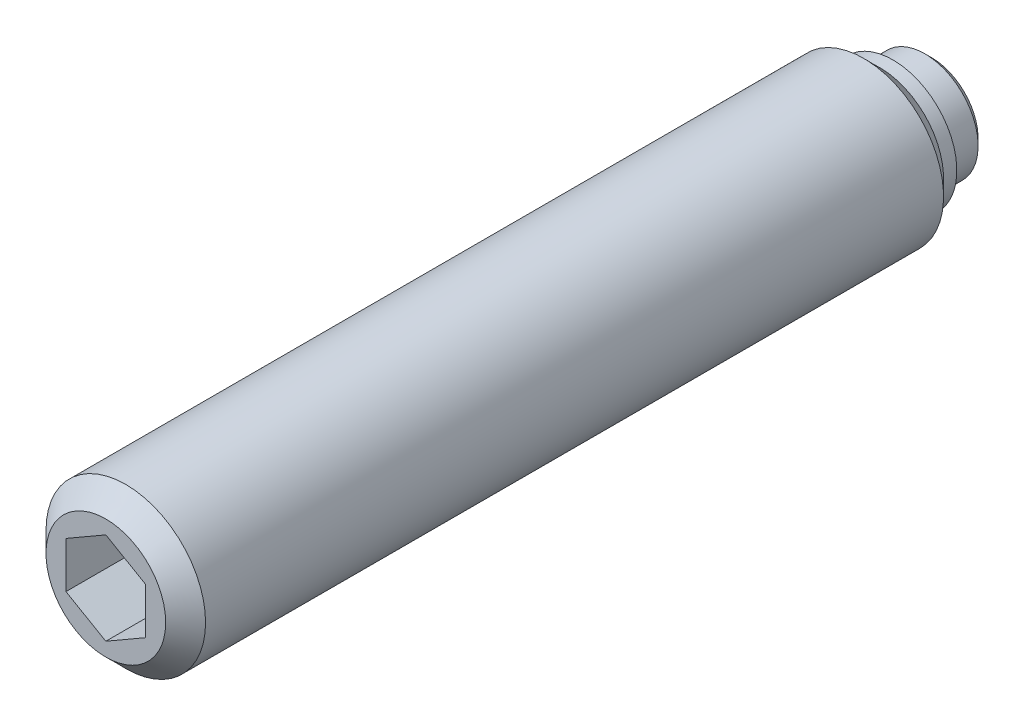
ISO-10303-21;
HEADER;
FILE_DESCRIPTION(('STEP AP214'),'2;1');
FILE_NAME('part.step','',(''),(''),'','','');
FILE_SCHEMA(('AUTOMOTIVE_DESIGN { 1 0 10303 214 1 1 1 1 }'));
ENDSEC;
DATA;
#1=APPLICATION_CONTEXT('core data for automotive mechanical design processes');
#2=APPLICATION_PROTOCOL_DEFINITION('international standard','automotive_design',2000,#1);
#3=PRODUCT_CONTEXT('',#1,'mechanical');
#4=PRODUCT('Part','Part','',(#3));
#5=PRODUCT_RELATED_PRODUCT_CATEGORY('part','',(#4));
#6=PRODUCT_DEFINITION_FORMATION('','',#4);
#7=PRODUCT_DEFINITION_CONTEXT('part definition',#1,'design');
#8=PRODUCT_DEFINITION('design','',#6,#7);
#9=PRODUCT_DEFINITION_SHAPE('','',#8);
#10=(LENGTH_UNIT() NAMED_UNIT(*) SI_UNIT(.MILLI.,.METRE.));
#11=(NAMED_UNIT(*) PLANE_ANGLE_UNIT() SI_UNIT($,.RADIAN.));
#12=(NAMED_UNIT(*) SI_UNIT($,.STERADIAN.) SOLID_ANGLE_UNIT());
#13=UNCERTAINTY_MEASURE_WITH_UNIT(LENGTH_MEASURE(1.E-05),#10,'distance_accuracy_value','');
#14=(GEOMETRIC_REPRESENTATION_CONTEXT(3) GLOBAL_UNCERTAINTY_ASSIGNED_CONTEXT((#13)) GLOBAL_UNIT_ASSIGNED_CONTEXT((#10,
#11,#12)) REPRESENTATION_CONTEXT('',''));
#15=CARTESIAN_POINT('',(0.,0.,0.));
#16=DIRECTION('',(0.,0.,1.));
#17=DIRECTION('',(1.,0.,0.));
#18=AXIS2_PLACEMENT_3D('',#15,#16,#17);
#19=CARTESIAN_POINT('',(0.,0.,0.));
#20=DIRECTION('',(0.,0.,-1.));
#21=DIRECTION('',(-1.,0.,0.));
#22=AXIS2_PLACEMENT_3D('',#19,#20,#21);
#23=CYLINDRICAL_SURFACE('',#22,4.);
#24=CARTESIAN_POINT('',(0.,0.,0.5));
#25=DIRECTION('',(0.,0.,-1.));
#26=DIRECTION('',(-1.,0.,0.));
#27=AXIS2_PLACEMENT_3D('',#24,#25,#26);
#28=CIRCLE('',#27,4.);
#29=CARTESIAN_POINT('',(-4.,0.,0.5));
#30=VERTEX_POINT('',#29);
#31=EDGE_CURVE('E133',#30,#30,#28,.T.);
#32=ORIENTED_EDGE('',*,*,#31,.F.);
#33=EDGE_LOOP('',(#32));
#34=FACE_BOUND('',#33,.T.);
#35=CARTESIAN_POINT('',(0.,0.,2.9));
#36=DIRECTION('',(0.,0.,-1.));
#37=DIRECTION('',(-1.,0.,0.));
#38=AXIS2_PLACEMENT_3D('',#35,#36,#37);
#39=CIRCLE('',#38,4.);
#40=CARTESIAN_POINT('',(-4.,0.,2.9));
#41=VERTEX_POINT('',#40);
#42=EDGE_CURVE('E127',#41,#41,#39,.T.);
#43=ORIENTED_EDGE('',*,*,#42,.T.);
#44=EDGE_LOOP('',(#43));
#45=FACE_BOUND('',#44,.T.);
#46=ADVANCED_FACE('F14',(#34,#45),#23,.T.);
#47=CARTESIAN_POINT('',(0.,0.,0.5));
#48=DIRECTION('',(0.,0.,1.));
#49=DIRECTION('',(1.,0.,0.));
#50=AXIS2_PLACEMENT_3D('',#47,#48,#49);
#51=CONICAL_SURFACE('',#50,4.,0.785398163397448);
#52=CARTESIAN_POINT('',(0.,0.,0.));
#53=DIRECTION('',(0.,0.,-1.));
#54=DIRECTION('',(-1.,0.,0.));
#55=AXIS2_PLACEMENT_3D('',#52,#53,#54);
#56=CIRCLE('',#55,3.5);
#57=CARTESIAN_POINT('',(-3.5,0.,0.));
#58=VERTEX_POINT('',#57);
#59=EDGE_CURVE('E130',#58,#58,#56,.T.);
#60=ORIENTED_EDGE('',*,*,#59,.F.);
#61=EDGE_LOOP('',(#60));
#62=FACE_BOUND('',#61,.T.);
#63=ORIENTED_EDGE('',*,*,#31,.T.);
#64=EDGE_LOOP('',(#63));
#65=FACE_BOUND('',#64,.T.);
#66=ADVANCED_FACE('F159',(#62,#65),#51,.T.);
#67=CARTESIAN_POINT('',(0.,3.5,0.));
#68=DIRECTION('',(0.,0.,1.));
#69=DIRECTION('',(1.,0.,0.));
#70=AXIS2_PLACEMENT_3D('',#67,#68,#69);
#71=PLANE('',#70);
#72=ORIENTED_EDGE('',*,*,#59,.T.);
#73=EDGE_LOOP('',(#72));
#74=FACE_BOUND('',#73,.T.);
#75=ADVANCED_FACE('F165',(#74),#71,.F.);
#76=CARTESIAN_POINT('',(0.,0.,2.9));
#77=DIRECTION('',(0.,0.,-1.));
#78=DIRECTION('',(-1.,0.,0.));
#79=AXIS2_PLACEMENT_3D('',#76,#77,#78);
#80=CYLINDRICAL_SURFACE('',#79,6.);
#81=CARTESIAN_POINT('',(0.,0.,5.1));
#82=DIRECTION('',(0.,0.,-1.));
#83=DIRECTION('',(-1.,0.,0.));
#84=AXIS2_PLACEMENT_3D('',#81,#82,#83);
#85=CIRCLE('',#84,6.);
#86=CARTESIAN_POINT('',(-6.,0.,5.1));
#87=VERTEX_POINT('',#86);
#88=EDGE_CURVE('E9',#87,#87,#85,.T.);
#89=ORIENTED_EDGE('',*,*,#88,.F.);
#90=EDGE_LOOP('',(#89));
#91=FACE_BOUND('',#90,.T.);
#92=CARTESIAN_POINT('',(0.,0.,60.6));
#93=DIRECTION('',(0.,0.,1.));
#94=DIRECTION('',(1.,0.,0.));
#95=AXIS2_PLACEMENT_3D('',#92,#93,#94);
#96=CIRCLE('',#95,6.);
#97=CARTESIAN_POINT('',(6.,0.,60.6));
#98=VERTEX_POINT('',#97);
#99=EDGE_CURVE('E124',#98,#98,#96,.T.);
#100=ORIENTED_EDGE('',*,*,#99,.F.);
#101=EDGE_LOOP('',(#100));
#102=FACE_BOUND('',#101,.T.);
#103=ADVANCED_FACE('F16',(#91,#102),#80,.T.);
#104=CARTESIAN_POINT('',(0.,4.8,2.9));
#105=DIRECTION('',(0.,0.,1.));
#106=DIRECTION('',(1.,0.,0.));
#107=AXIS2_PLACEMENT_3D('',#104,#105,#106);
#108=PLANE('',#107);
#109=CARTESIAN_POINT('',(0.,0.,2.9));
#110=DIRECTION('',(0.,0.,-1.));
#111=DIRECTION('',(-1.,0.,0.));
#112=AXIS2_PLACEMENT_3D('',#109,#110,#111);
#113=CIRCLE('',#112,4.8);
#114=CARTESIAN_POINT('',(-4.8,0.,2.9));
#115=VERTEX_POINT('',#114);
#116=EDGE_CURVE('E136',#115,#115,#113,.T.);
#117=ORIENTED_EDGE('',*,*,#116,.T.);
#118=EDGE_LOOP('',(#117));
#119=FACE_BOUND('',#118,.T.);
#120=ORIENTED_EDGE('',*,*,#42,.F.);
#121=EDGE_LOOP('',(#120));
#122=FACE_BOUND('',#121,.T.);
#123=ADVANCED_FACE('F156',(#119,#122),#108,.F.);
#124=CARTESIAN_POINT('',(0.,0.,2.9));
#125=DIRECTION('',(0.,0.,-1.));
#126=DIRECTION('',(-1.,0.,0.));
#127=AXIS2_PLACEMENT_3D('',#124,#125,#126);
#128=CYLINDRICAL_SURFACE('',#127,4.8);
#129=CARTESIAN_POINT('',(0.,0.,3.9));
#130=DIRECTION('',(0.,0.,-1.));
#131=DIRECTION('',(-1.,0.,0.));
#132=AXIS2_PLACEMENT_3D('',#129,#130,#131);
#133=CIRCLE('',#132,4.8);
#134=CARTESIAN_POINT('',(-4.8,0.,3.9));
#135=VERTEX_POINT('',#134);
#136=EDGE_CURVE('E22',#135,#135,#133,.T.);
#137=ORIENTED_EDGE('',*,*,#136,.T.);
#138=EDGE_LOOP('',(#137));
#139=FACE_BOUND('',#138,.T.);
#140=ORIENTED_EDGE('',*,*,#116,.F.);
#141=EDGE_LOOP('',(#140));
#142=FACE_BOUND('',#141,.T.);
#143=ADVANCED_FACE('F141',(#139,#142),#128,.T.);
#144=CARTESIAN_POINT('',(0.,0.,5.1));
#145=DIRECTION('',(0.,0.,1.));
#146=DIRECTION('',(1.,0.,0.));
#147=AXIS2_PLACEMENT_3D('',#144,#145,#146);
#148=CONICAL_SURFACE('',#147,6.,0.785398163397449);
#149=ORIENTED_EDGE('',*,*,#88,.T.);
#150=EDGE_LOOP('',(#149));
#151=FACE_BOUND('',#150,.T.);
#152=ORIENTED_EDGE('',*,*,#136,.F.);
#153=EDGE_LOOP('',(#152));
#154=FACE_BOUND('',#153,.T.);
#155=ADVANCED_FACE('F144',(#151,#154),#148,.T.);
#156=CARTESIAN_POINT('',(0.,-4.5,62.1));
#157=DIRECTION('',(0.,0.,1.));
#158=DIRECTION('',(1.,0.,0.));
#159=AXIS2_PLACEMENT_3D('',#156,#157,#158);
#160=PLANE('',#159);
#161=DIRECTION('',(0.866025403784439,-0.5,0.));
#162=VECTOR('',#161,1.);
#163=CARTESIAN_POINT('',(-3.,-1.73205080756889,62.1));
#164=LINE('',#163,#162);
#165=CARTESIAN_POINT('',(-3.,-1.73205080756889,62.1));
#166=VERTEX_POINT('',#165);
#167=CARTESIAN_POINT('',(0.,-3.46410161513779,62.1));
#168=VERTEX_POINT('',#167);
#169=EDGE_CURVE('E29',#166,#168,#164,.T.);
#170=ORIENTED_EDGE('',*,*,#169,.F.);
#171=DIRECTION('',(0.,-1.,0.));
#172=VECTOR('',#171,1.);
#173=CARTESIAN_POINT('',(-3.,1.73205080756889,62.1));
#174=LINE('',#173,#172);
#175=CARTESIAN_POINT('',(-3.,1.73205080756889,62.1));
#176=VERTEX_POINT('',#175);
#177=EDGE_CURVE('E112',#176,#166,#174,.T.);
#178=ORIENTED_EDGE('',*,*,#177,.F.);
#179=DIRECTION('',(-0.866025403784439,-0.5,0.));
#180=VECTOR('',#179,1.);
#181=CARTESIAN_POINT('',(0.,3.46410161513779,62.1));
#182=LINE('',#181,#180);
#183=CARTESIAN_POINT('',(0.,3.46410161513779,62.1));
#184=VERTEX_POINT('',#183);
#185=EDGE_CURVE('E110',#184,#176,#182,.T.);
#186=ORIENTED_EDGE('',*,*,#185,.F.);
#187=DIRECTION('',(-0.866025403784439,0.5,0.));
#188=VECTOR('',#187,1.);
#189=CARTESIAN_POINT('',(3.,1.73205080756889,62.1));
#190=LINE('',#189,#188);
#191=CARTESIAN_POINT('',(3.,1.73205080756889,62.1));
#192=VERTEX_POINT('',#191);
#193=EDGE_CURVE('E77',#192,#184,#190,.T.);
#194=ORIENTED_EDGE('',*,*,#193,.F.);
#195=DIRECTION('',(0.,1.,0.));
#196=VECTOR('',#195,1.);
#197=CARTESIAN_POINT('',(3.,-1.73205080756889,62.1));
#198=LINE('',#197,#196);
#199=CARTESIAN_POINT('',(3.,-1.73205080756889,62.1));
#200=VERTEX_POINT('',#199);
#201=EDGE_CURVE('E106',#200,#192,#198,.T.);
#202=ORIENTED_EDGE('',*,*,#201,.F.);
#203=DIRECTION('',(0.866025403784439,0.5,0.));
#204=VECTOR('',#203,1.);
#205=CARTESIAN_POINT('',(0.,-3.46410161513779,62.1));
#206=LINE('',#205,#204);
#207=EDGE_CURVE('E103',#168,#200,#206,.T.);
#208=ORIENTED_EDGE('',*,*,#207,.F.);
#209=EDGE_LOOP('',(#170,#178,#186,#194,#202,#208));
#210=FACE_BOUND('',#209,.T.);
#211=CARTESIAN_POINT('',(0.,0.,62.1));
#212=DIRECTION('',(0.,0.,1.));
#213=DIRECTION('',(1.,0.,0.));
#214=AXIS2_PLACEMENT_3D('',#211,#212,#213);
#215=CIRCLE('',#214,4.5);
#216=CARTESIAN_POINT('',(4.5,0.,62.1));
#217=VERTEX_POINT('',#216);
#218=EDGE_CURVE('E116',#217,#217,#215,.T.);
#219=ORIENTED_EDGE('',*,*,#218,.T.);
#220=EDGE_LOOP('',(#219));
#221=FACE_BOUND('',#220,.T.);
#222=ADVANCED_FACE('F146',(#210,#221),#160,.T.);
#223=CARTESIAN_POINT('',(0.,0.,62.1));
#224=DIRECTION('',(0.,0.,-1.));
#225=DIRECTION('',(-1.,0.,0.));
#226=AXIS2_PLACEMENT_3D('',#223,#224,#225);
#227=CONICAL_SURFACE('',#226,4.5,0.785398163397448);
#228=ORIENTED_EDGE('',*,*,#99,.T.);
#229=EDGE_LOOP('',(#228));
#230=FACE_BOUND('',#229,.T.);
#231=ORIENTED_EDGE('',*,*,#218,.F.);
#232=EDGE_LOOP('',(#231));
#233=FACE_BOUND('',#232,.T.);
#234=ADVANCED_FACE('F153',(#230,#233),#227,.T.);
#235=CARTESIAN_POINT('',(-3.,-1.73205080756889,54.1));
#236=DIRECTION('',(-0.5,-0.866025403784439,0.));
#237=DIRECTION('',(0.866025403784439,-0.5,0.));
#238=AXIS2_PLACEMENT_3D('',#235,#236,#237);
#239=PLANE('',#238);
#240=ORIENTED_EDGE('',*,*,#169,.T.);
#241=DIRECTION('',(0.,0.,1.));
#242=VECTOR('',#241,1.);
#243=CARTESIAN_POINT('',(0.,-3.46410161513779,54.1));
#244=LINE('',#243,#242);
#245=CARTESIAN_POINT('',(0.,-3.46410161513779,54.1));
#246=VERTEX_POINT('',#245);
#247=EDGE_CURVE('E59',#246,#168,#244,.T.);
#248=ORIENTED_EDGE('',*,*,#247,.F.);
#249=DIRECTION('',(0.866025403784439,-0.5,0.));
#250=VECTOR('',#249,1.);
#251=CARTESIAN_POINT('',(-3.,-1.73205080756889,54.1));
#252=LINE('',#251,#250);
#253=CARTESIAN_POINT('',(-3.,-1.73205080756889,54.1));
#254=VERTEX_POINT('',#253);
#255=EDGE_CURVE('E114',#254,#246,#252,.T.);
#256=ORIENTED_EDGE('',*,*,#255,.F.);
#257=DIRECTION('',(0.,0.,1.));
#258=VECTOR('',#257,1.);
#259=CARTESIAN_POINT('',(-3.,-1.73205080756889,54.1));
#260=LINE('',#259,#258);
#261=EDGE_CURVE('E37',#254,#166,#260,.T.);
#262=ORIENTED_EDGE('',*,*,#261,.T.);
#263=EDGE_LOOP('',(#240,#248,#256,#262));
#264=FACE_BOUND('',#263,.T.);
#265=ADVANCED_FACE('F191',(#264),#239,.F.);
#266=CARTESIAN_POINT('',(-3.,1.73205080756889,54.1));
#267=DIRECTION('',(-1.,0.,0.));
#268=DIRECTION('',(0.,0.,1.));
#269=AXIS2_PLACEMENT_3D('',#266,#267,#268);
#270=PLANE('',#269);
#271=ORIENTED_EDGE('',*,*,#177,.T.);
#272=ORIENTED_EDGE('',*,*,#261,.F.);
#273=DIRECTION('',(0.,-1.,0.));
#274=VECTOR('',#273,1.);
#275=CARTESIAN_POINT('',(-3.,1.73205080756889,54.1));
#276=LINE('',#275,#274);
#277=CARTESIAN_POINT('',(-3.,1.73205080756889,54.1));
#278=VERTEX_POINT('',#277);
#279=EDGE_CURVE('E89',#278,#254,#276,.T.);
#280=ORIENTED_EDGE('',*,*,#279,.F.);
#281=DIRECTION('',(0.,0.,1.));
#282=VECTOR('',#281,1.);
#283=CARTESIAN_POINT('',(-3.,1.73205080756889,54.1));
#284=LINE('',#283,#282);
#285=EDGE_CURVE('E81',#278,#176,#284,.T.);
#286=ORIENTED_EDGE('',*,*,#285,.T.);
#287=EDGE_LOOP('',(#271,#272,#280,#286));
#288=FACE_BOUND('',#287,.T.);
#289=ADVANCED_FACE('F198',(#288),#270,.F.);
#290=CARTESIAN_POINT('',(0.,3.46410161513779,54.1));
#291=DIRECTION('',(-0.5,0.866025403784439,0.));
#292=DIRECTION('',(-0.866025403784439,-0.5,0.));
#293=AXIS2_PLACEMENT_3D('',#290,#291,#292);
#294=PLANE('',#293);
#295=ORIENTED_EDGE('',*,*,#185,.T.);
#296=ORIENTED_EDGE('',*,*,#285,.F.);
#297=DIRECTION('',(-0.866025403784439,-0.5,0.));
#298=VECTOR('',#297,1.);
#299=CARTESIAN_POINT('',(0.,3.46410161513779,54.1));
#300=LINE('',#299,#298);
#301=CARTESIAN_POINT('',(0.,3.46410161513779,54.1));
#302=VERTEX_POINT('',#301);
#303=EDGE_CURVE('E85',#302,#278,#300,.T.);
#304=ORIENTED_EDGE('',*,*,#303,.F.);
#305=DIRECTION('',(0.,0.,1.));
#306=VECTOR('',#305,1.);
#307=CARTESIAN_POINT('',(0.,3.46410161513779,54.1));
#308=LINE('',#307,#306);
#309=EDGE_CURVE('E70',#302,#184,#308,.T.);
#310=ORIENTED_EDGE('',*,*,#309,.T.);
#311=EDGE_LOOP('',(#295,#296,#304,#310));
#312=FACE_BOUND('',#311,.T.);
#313=ADVANCED_FACE('F86',(#312),#294,.F.);
#314=CARTESIAN_POINT('',(3.,1.73205080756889,54.1));
#315=DIRECTION('',(0.5,0.866025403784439,0.));
#316=DIRECTION('',(-0.866025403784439,0.5,0.));
#317=AXIS2_PLACEMENT_3D('',#314,#315,#316);
#318=PLANE('',#317);
#319=ORIENTED_EDGE('',*,*,#193,.T.);
#320=ORIENTED_EDGE('',*,*,#309,.F.);
#321=DIRECTION('',(-0.866025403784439,0.5,0.));
#322=VECTOR('',#321,1.);
#323=CARTESIAN_POINT('',(3.,1.73205080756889,54.1));
#324=LINE('',#323,#322);
#325=CARTESIAN_POINT('',(3.,1.73205080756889,54.1));
#326=VERTEX_POINT('',#325);
#327=EDGE_CURVE('E74',#326,#302,#324,.T.);
#328=ORIENTED_EDGE('',*,*,#327,.F.);
#329=DIRECTION('',(0.,0.,1.));
#330=VECTOR('',#329,1.);
#331=CARTESIAN_POINT('',(3.,1.73205080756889,54.1));
#332=LINE('',#331,#330);
#333=EDGE_CURVE('E82',#326,#192,#332,.T.);
#334=ORIENTED_EDGE('',*,*,#333,.T.);
#335=EDGE_LOOP('',(#319,#320,#328,#334));
#336=FACE_BOUND('',#335,.T.);
#337=ADVANCED_FACE('F72',(#336),#318,.F.);
#338=CARTESIAN_POINT('',(3.,-1.73205080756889,54.1));
#339=DIRECTION('',(1.,0.,0.));
#340=DIRECTION('',(0.,0.,-1.));
#341=AXIS2_PLACEMENT_3D('',#338,#339,#340);
#342=PLANE('',#341);
#343=ORIENTED_EDGE('',*,*,#201,.T.);
#344=ORIENTED_EDGE('',*,*,#333,.F.);
#345=DIRECTION('',(0.,1.,0.));
#346=VECTOR('',#345,1.);
#347=CARTESIAN_POINT('',(3.,-1.73205080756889,54.1));
#348=LINE('',#347,#346);
#349=CARTESIAN_POINT('',(3.,-1.73205080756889,54.1));
#350=VERTEX_POINT('',#349);
#351=EDGE_CURVE('E95',#350,#326,#348,.T.);
#352=ORIENTED_EDGE('',*,*,#351,.F.);
#353=DIRECTION('',(0.,0.,1.));
#354=VECTOR('',#353,1.);
#355=CARTESIAN_POINT('',(3.,-1.73205080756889,54.1));
#356=LINE('',#355,#354);
#357=EDGE_CURVE('E119',#350,#200,#356,.T.);
#358=ORIENTED_EDGE('',*,*,#357,.T.);
#359=EDGE_LOOP('',(#343,#344,#352,#358));
#360=FACE_BOUND('',#359,.T.);
#361=ADVANCED_FACE('F204',(#360),#342,.F.);
#362=CARTESIAN_POINT('',(0.,-3.46410161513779,54.1));
#363=DIRECTION('',(0.5,-0.866025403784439,0.));
#364=DIRECTION('',(0.866025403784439,0.5,0.));
#365=AXIS2_PLACEMENT_3D('',#362,#363,#364);
#366=PLANE('',#365);
#367=ORIENTED_EDGE('',*,*,#207,.T.);
#368=ORIENTED_EDGE('',*,*,#357,.F.);
#369=DIRECTION('',(0.866025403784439,0.5,0.));
#370=VECTOR('',#369,1.);
#371=CARTESIAN_POINT('',(0.,-3.46410161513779,54.1));
#372=LINE('',#371,#370);
#373=EDGE_CURVE('E97',#246,#350,#372,.T.);
#374=ORIENTED_EDGE('',*,*,#373,.F.);
#375=ORIENTED_EDGE('',*,*,#247,.T.);
#376=EDGE_LOOP('',(#367,#368,#374,#375));
#377=FACE_BOUND('',#376,.T.);
#378=ADVANCED_FACE('F201',(#377),#366,.F.);
#379=CARTESIAN_POINT('',(0.,0.,54.1));
#380=DIRECTION('',(0.,0.,1.));
#381=DIRECTION('',(1.,0.,0.));
#382=AXIS2_PLACEMENT_3D('',#379,#380,#381);
#383=PLANE('',#382);
#384=ORIENTED_EDGE('',*,*,#255,.T.);
#385=ORIENTED_EDGE('',*,*,#373,.T.);
#386=ORIENTED_EDGE('',*,*,#351,.T.);
#387=ORIENTED_EDGE('',*,*,#327,.T.);
#388=ORIENTED_EDGE('',*,*,#303,.T.);
#389=ORIENTED_EDGE('',*,*,#279,.T.);
#390=EDGE_LOOP('',(#384,#385,#386,#387,#388,#389));
#391=FACE_BOUND('',#390,.T.);
#392=ADVANCED_FACE('F92',(#391),#383,.T.);
#393=CLOSED_SHELL('',(#46,#66,#75,#103,#123,#143,#155,#222,#234,#265,#289,#313,#337,#361,#378,#392));
#394=MANIFOLD_SOLID_BREP('B1',#393);
#395=ADVANCED_BREP_SHAPE_REPRESENTATION('',(#18,#394),#14);
#396=SHAPE_DEFINITION_REPRESENTATION(#9,#395);
ENDSEC;
END-ISO-10303-21;
